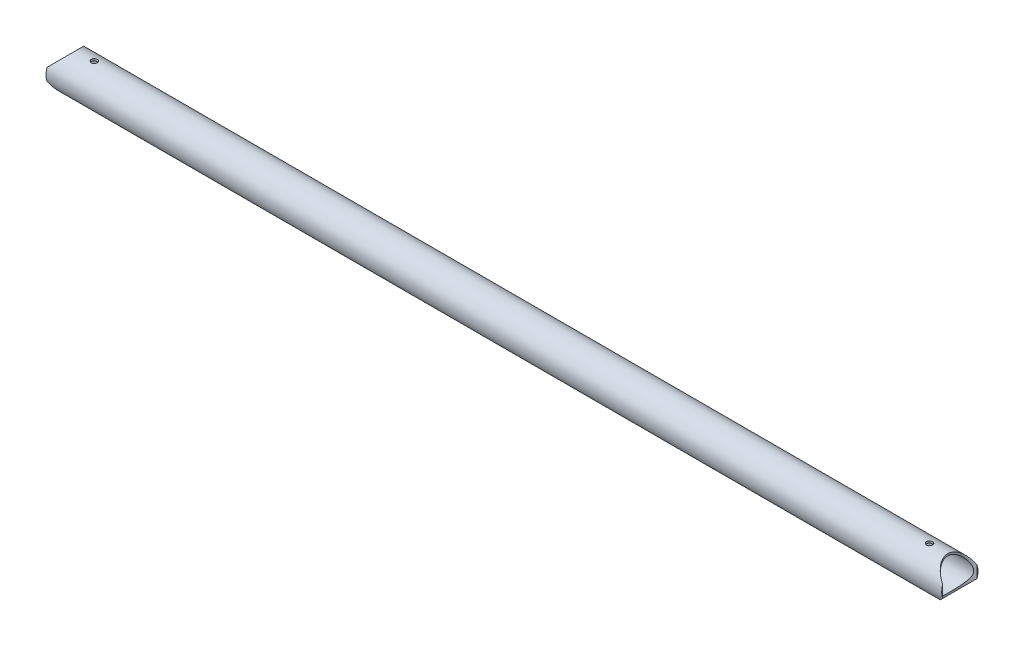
from build123d import *

# Parameters (mm, degrees)
SKETCH1_R      = 19.05
SKETCH1_R_2    = 16.9418
EXTRUDE1_DEPTH = 469.9
SKETCH2_R      = 19.05
SKETCH2_R_2    = 3.175
EXTRUDE2_DEPTH = 471.671663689


with BuildPart() as part:
    # Sketch1 → Extrude1 (new, symmetric)
    with BuildSketch(Plane(origin=(0, 0, 0), x_dir=(0, 0, -1), z_dir=(1, 0, 0))):
        Circle(SKETCH1_R)
        Circle(SKETCH1_R_2, mode=Mode.SUBTRACT)
    extrude(amount=EXTRUDE1_DEPTH, both=True)

    # Sketch2 → Extrude2 (cut, symmetric)
    with BuildSketch(Plane(origin=(0, 0, 0), x_dir=(1, 0, 0), z_dir=(0, 1, 0))):
        with Locations((-476.25, 0)):
            Circle(SKETCH2_R)
        with Locations(Location((-438.15, 0, 0), (0, 0, 270))):
            Circle(SKETCH2_R_2)
    extrude2 = extrude(amount=EXTRUDE2_DEPTH, both=True, mode=Mode.SUBTRACT)

    # Mirror1: Extrude2 across plane
    add(extrude2.mirror(Plane(origin=(0, 0, 0), x_dir=(0, 0, 1), z_dir=(1, 0, 0))), mode=Mode.SUBTRACT)


solid = part.part
